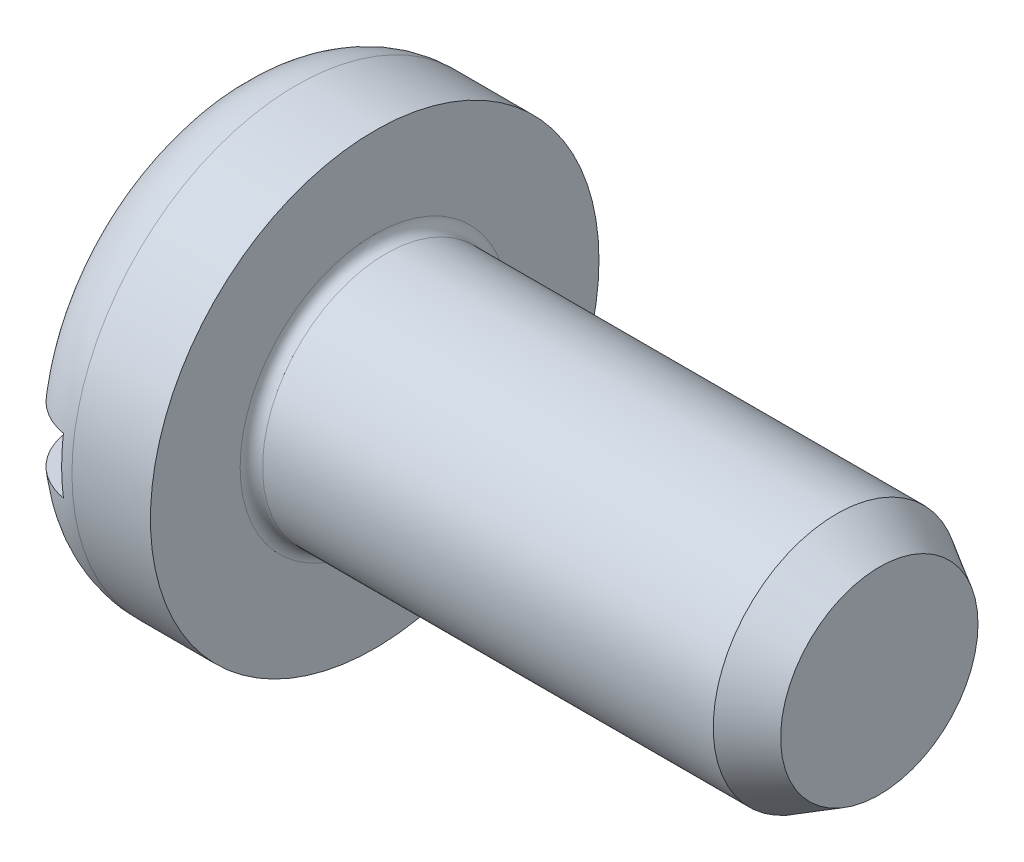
from build123d import *

# Parameters (mm, degrees)
CHAMFER1_SIZE  = 0.22
CHAMFER1_SIZE2 = 0.381051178
FILLET1_R      = 0.1
FILLET2_R      = 0.6
SKETCH7_W      = 1.5
SKETCH7_H      = 0.5
SLOT_DEPTH     = 15


with BuildPart() as part:
    # Sketch1 → Revolve1 (revolve)
    with BuildSketch(Plane.XY, mode=Mode.PRIVATE) as revolve1_sk:
        Polygon((0, 0), (0, 2), (1.3, 2), (1.3, 1.1), (5.8, 1.1), (5.8, 0), align=None)
    revolve(revolve1_sk.sketch.rotate(Axis((13.107885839, 0, 0), (-1, 0, 0)), 90), axis=Axis((13.107885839, 0, 0), (-1, 0, 0)))

    # Chamfer1
    chamfer1_edges = [part.edges().sort_by_distance(p)[0] for p in [
        (5.8, 0, 1.1),
    ]]
    chamfer1_side = [part.faces().sort_by_distance(p)[0] for p in [
        (5.8, 0, 0),
    ]]
    chamfer(chamfer1_edges, length=CHAMFER1_SIZE, length2=CHAMFER1_SIZE2, reference=chamfer1_side[0])

    # Fillet1
    fillet1_edges = [part.edges().sort_by_distance(p)[0] for p in [
        (1.3, 0, 1.1),
    ]]
    fillet(fillet1_edges, radius=FILLET1_R)

    # Fillet2
    fillet2_edges = [part.edges().sort_by_distance(p)[0] for p in [
        (0, 0, 2),
    ]]
    fillet(fillet2_edges, radius=FILLET2_R)

    # Sketch7 → Slot (cut, symmetric)
    with BuildSketch(Plane.XY):
        with Locations((-0.25, 0)):
            Rectangle(SKETCH7_W, SKETCH7_H)
    extrude(amount=SLOT_DEPTH, both=True, mode=Mode.SUBTRACT)


solid = part.part
